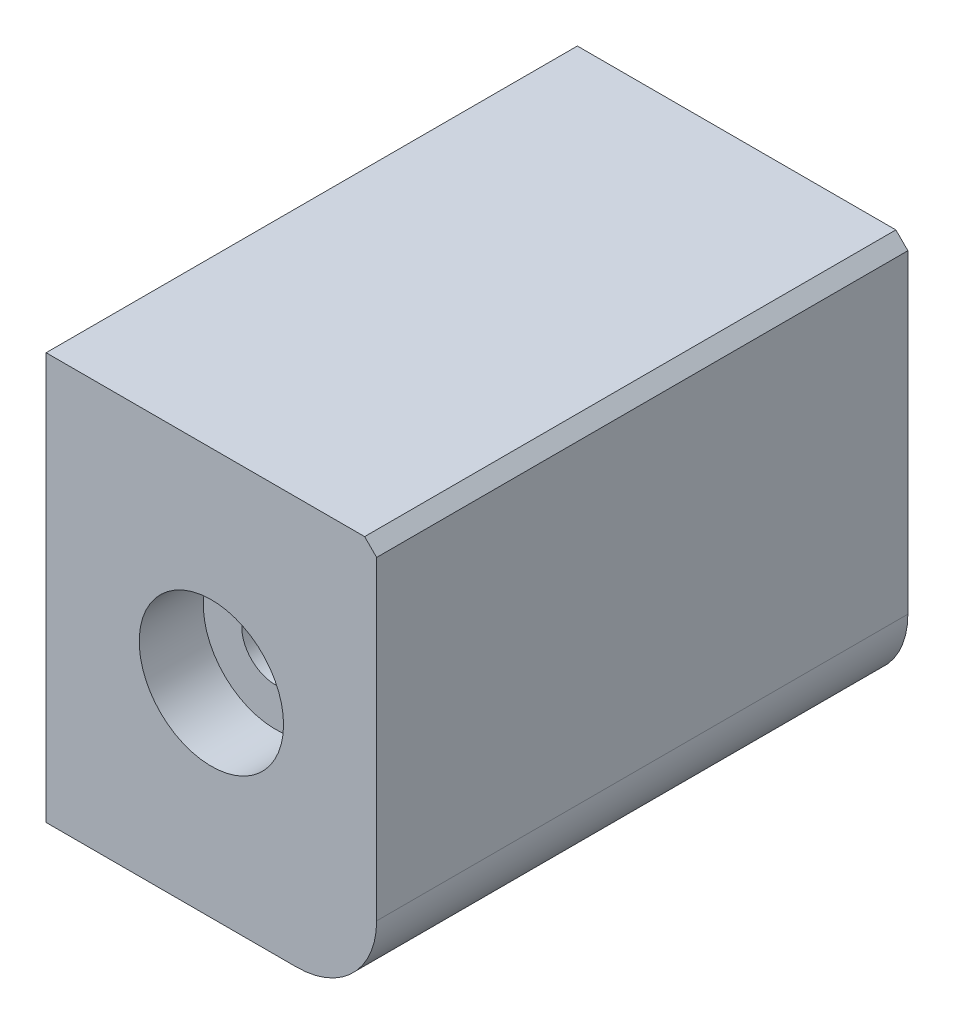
ISO-10303-21;
HEADER;
FILE_DESCRIPTION(('STEP AP214'),'2;1');
FILE_NAME('part.step','',(''),(''),'','','');
FILE_SCHEMA(('AUTOMOTIVE_DESIGN { 1 0 10303 214 1 1 1 1 }'));
ENDSEC;
DATA;
#1=APPLICATION_CONTEXT('core data for automotive mechanical design processes');
#2=APPLICATION_PROTOCOL_DEFINITION('international standard','automotive_design',2000,#1);
#3=PRODUCT_CONTEXT('',#1,'mechanical');
#4=PRODUCT('Part','Part','',(#3));
#5=PRODUCT_RELATED_PRODUCT_CATEGORY('part','',(#4));
#6=PRODUCT_DEFINITION_FORMATION('','',#4);
#7=PRODUCT_DEFINITION_CONTEXT('part definition',#1,'design');
#8=PRODUCT_DEFINITION('design','',#6,#7);
#9=PRODUCT_DEFINITION_SHAPE('','',#8);
#10=(LENGTH_UNIT() NAMED_UNIT(*) SI_UNIT(.MILLI.,.METRE.));
#11=(NAMED_UNIT(*) PLANE_ANGLE_UNIT() SI_UNIT($,.RADIAN.));
#12=(NAMED_UNIT(*) SI_UNIT($,.STERADIAN.) SOLID_ANGLE_UNIT());
#13=UNCERTAINTY_MEASURE_WITH_UNIT(LENGTH_MEASURE(1.E-05),#10,'distance_accuracy_value','');
#14=(GEOMETRIC_REPRESENTATION_CONTEXT(3) GLOBAL_UNCERTAINTY_ASSIGNED_CONTEXT((#13)) GLOBAL_UNIT_ASSIGNED_CONTEXT((#10,
#11,#12)) REPRESENTATION_CONTEXT('',''));
#15=CARTESIAN_POINT('',(0.,0.,0.));
#16=DIRECTION('',(0.,0.,1.));
#17=DIRECTION('',(1.,0.,0.));
#18=AXIS2_PLACEMENT_3D('',#15,#16,#17);
#19=CARTESIAN_POINT('',(31.27,-40.8,66.33));
#20=DIRECTION('',(0.,0.,-1.));
#21=DIRECTION('',(-1.,0.,0.));
#22=AXIS2_PLACEMENT_3D('',#19,#20,#21);
#23=CYLINDRICAL_SURFACE('',#22,10.);
#24=CARTESIAN_POINT('',(31.27,-40.8,0.));
#25=DIRECTION('',(0.,0.,1.));
#26=DIRECTION('',(-1.,0.,0.));
#27=AXIS2_PLACEMENT_3D('',#24,#25,#26);
#28=CIRCLE('',#27,10.);
#29=CARTESIAN_POINT('',(31.27,-50.8,0.));
#30=VERTEX_POINT('',#29);
#31=CARTESIAN_POINT('',(41.27,-40.8,0.));
#32=VERTEX_POINT('',#31);
#33=EDGE_CURVE('E121',#30,#32,#28,.T.);
#34=ORIENTED_EDGE('',*,*,#33,.T.);
#35=DIRECTION('',(0.,0.,-1.));
#36=VECTOR('',#35,1.);
#37=CARTESIAN_POINT('',(41.27,-40.8,66.33));
#38=LINE('',#37,#36);
#39=CARTESIAN_POINT('',(41.27,-40.8,66.33));
#40=VERTEX_POINT('',#39);
#41=EDGE_CURVE('E154',#40,#32,#38,.T.);
#42=ORIENTED_EDGE('',*,*,#41,.F.);
#43=CARTESIAN_POINT('',(31.27,-40.8,66.33));
#44=DIRECTION('',(0.,0.,1.));
#45=DIRECTION('',(-1.,0.,0.));
#46=AXIS2_PLACEMENT_3D('',#43,#44,#45);
#47=CIRCLE('',#46,10.);
#48=CARTESIAN_POINT('',(31.27,-50.8,66.33));
#49=VERTEX_POINT('',#48);
#50=EDGE_CURVE('E124',#49,#40,#47,.T.);
#51=ORIENTED_EDGE('',*,*,#50,.F.);
#52=DIRECTION('',(0.,0.,-1.));
#53=VECTOR('',#52,1.);
#54=CARTESIAN_POINT('',(31.27,-50.8,66.33));
#55=LINE('',#54,#53);
#56=EDGE_CURVE('E136',#49,#30,#55,.T.);
#57=ORIENTED_EDGE('',*,*,#56,.T.);
#58=EDGE_LOOP('',(#34,#42,#51,#57));
#59=FACE_BOUND('',#58,.T.);
#60=ADVANCED_FACE('F32',(#59),#23,.T.);
#61=CARTESIAN_POINT('',(41.27,-40.8,66.33));
#62=DIRECTION('',(-1.,0.,0.));
#63=DIRECTION('',(0.,-1.,0.));
#64=AXIS2_PLACEMENT_3D('',#61,#62,#63);
#65=PLANE('',#64);
#66=DIRECTION('',(0.,1.,0.));
#67=VECTOR('',#66,1.);
#68=CARTESIAN_POINT('',(41.27,-40.8,0.));
#69=LINE('',#68,#67);
#70=CARTESIAN_POINT('',(41.27,-1.49999999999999,0.));
#71=VERTEX_POINT('',#70);
#72=EDGE_CURVE('E139',#32,#71,#69,.T.);
#73=ORIENTED_EDGE('',*,*,#72,.T.);
#74=DIRECTION('',(0.,0.,1.));
#75=VECTOR('',#74,1.);
#76=CARTESIAN_POINT('',(41.27,-1.49999999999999,66.33));
#77=LINE('',#76,#75);
#78=CARTESIAN_POINT('',(41.27,-1.5,66.33));
#79=VERTEX_POINT('',#78);
#80=EDGE_CURVE('E40',#71,#79,#77,.T.);
#81=ORIENTED_EDGE('',*,*,#80,.T.);
#82=DIRECTION('',(0.,1.,0.));
#83=VECTOR('',#82,1.);
#84=CARTESIAN_POINT('',(41.27,-40.8,66.33));
#85=LINE('',#84,#83);
#86=EDGE_CURVE('E127',#40,#79,#85,.T.);
#87=ORIENTED_EDGE('',*,*,#86,.F.);
#88=ORIENTED_EDGE('',*,*,#41,.T.);
#89=EDGE_LOOP('',(#73,#81,#87,#88));
#90=FACE_BOUND('',#89,.T.);
#91=ADVANCED_FACE('F189',(#90),#65,.F.);
#92=CARTESIAN_POINT('',(0.,0.,66.33));
#93=DIRECTION('',(0.,-1.,0.));
#94=DIRECTION('',(1.,0.,0.));
#95=AXIS2_PLACEMENT_3D('',#92,#93,#94);
#96=PLANE('',#95);
#97=DIRECTION('',(-1.,0.,0.));
#98=VECTOR('',#97,1.);
#99=CARTESIAN_POINT('',(0.,0.,66.33));
#100=LINE('',#99,#98);
#101=CARTESIAN_POINT('',(39.77,0.,66.33));
#102=VERTEX_POINT('',#101);
#103=CARTESIAN_POINT('',(0.,0.,66.33));
#104=VERTEX_POINT('',#103);
#105=EDGE_CURVE('E130',#102,#104,#100,.T.);
#106=ORIENTED_EDGE('',*,*,#105,.F.);
#107=DIRECTION('',(0.,0.,-1.));
#108=VECTOR('',#107,1.);
#109=CARTESIAN_POINT('',(39.77,0.,66.33));
#110=LINE('',#109,#108);
#111=CARTESIAN_POINT('',(39.77,0.,0.));
#112=VERTEX_POINT('',#111);
#113=EDGE_CURVE('E157',#102,#112,#110,.T.);
#114=ORIENTED_EDGE('',*,*,#113,.T.);
#115=DIRECTION('',(-1.,0.,0.));
#116=VECTOR('',#115,1.);
#117=CARTESIAN_POINT('',(0.,0.,0.));
#118=LINE('',#117,#116);
#119=CARTESIAN_POINT('',(0.,0.,0.));
#120=VERTEX_POINT('',#119);
#121=EDGE_CURVE('E141',#112,#120,#118,.T.);
#122=ORIENTED_EDGE('',*,*,#121,.T.);
#123=DIRECTION('',(0.,0.,-1.));
#124=VECTOR('',#123,1.);
#125=CARTESIAN_POINT('',(0.,0.,66.33));
#126=LINE('',#125,#124);
#127=EDGE_CURVE('E151',#104,#120,#126,.T.);
#128=ORIENTED_EDGE('',*,*,#127,.F.);
#129=EDGE_LOOP('',(#106,#114,#122,#128));
#130=FACE_BOUND('',#129,.T.);
#131=ADVANCED_FACE('F165',(#130),#96,.F.);
#132=CARTESIAN_POINT('',(0.,-50.8,66.33));
#133=DIRECTION('',(1.,0.,0.));
#134=DIRECTION('',(0.,0.,-1.));
#135=AXIS2_PLACEMENT_3D('',#132,#133,#134);
#136=PLANE('',#135);
#137=DIRECTION('',(0.,-1.,0.));
#138=VECTOR('',#137,1.);
#139=CARTESIAN_POINT('',(0.,-50.8,0.));
#140=LINE('',#139,#138);
#141=CARTESIAN_POINT('',(0.,-50.8,0.));
#142=VERTEX_POINT('',#141);
#143=EDGE_CURVE('E143',#120,#142,#140,.T.);
#144=ORIENTED_EDGE('',*,*,#143,.T.);
#145=DIRECTION('',(0.,0.,-1.));
#146=VECTOR('',#145,1.);
#147=CARTESIAN_POINT('',(0.,-50.8,66.33));
#148=LINE('',#147,#146);
#149=CARTESIAN_POINT('',(0.,-50.8,66.33));
#150=VERTEX_POINT('',#149);
#151=EDGE_CURVE('E148',#150,#142,#148,.T.);
#152=ORIENTED_EDGE('',*,*,#151,.F.);
#153=DIRECTION('',(0.,-1.,0.));
#154=VECTOR('',#153,1.);
#155=CARTESIAN_POINT('',(0.,-50.8,66.33));
#156=LINE('',#155,#154);
#157=EDGE_CURVE('E132',#104,#150,#156,.T.);
#158=ORIENTED_EDGE('',*,*,#157,.F.);
#159=ORIENTED_EDGE('',*,*,#127,.T.);
#160=EDGE_LOOP('',(#144,#152,#158,#159));
#161=FACE_BOUND('',#160,.T.);
#162=ADVANCED_FACE('F175',(#161),#136,.F.);
#163=CARTESIAN_POINT('',(0.,-50.8,66.33));
#164=DIRECTION('',(0.,1.,0.));
#165=DIRECTION('',(0.,0.,1.));
#166=AXIS2_PLACEMENT_3D('',#163,#164,#165);
#167=PLANE('',#166);
#168=DIRECTION('',(1.,0.,0.));
#169=VECTOR('',#168,1.);
#170=CARTESIAN_POINT('',(0.,-50.8,0.));
#171=LINE('',#170,#169);
#172=EDGE_CURVE('E128',#142,#30,#171,.T.);
#173=ORIENTED_EDGE('',*,*,#172,.T.);
#174=ORIENTED_EDGE('',*,*,#56,.F.);
#175=DIRECTION('',(1.,0.,0.));
#176=VECTOR('',#175,1.);
#177=CARTESIAN_POINT('',(0.,-50.8,66.33));
#178=LINE('',#177,#176);
#179=EDGE_CURVE('E134',#150,#49,#178,.T.);
#180=ORIENTED_EDGE('',*,*,#179,.F.);
#181=ORIENTED_EDGE('',*,*,#151,.T.);
#182=EDGE_LOOP('',(#173,#174,#180,#181));
#183=FACE_BOUND('',#182,.T.);
#184=ADVANCED_FACE('F179',(#183),#167,.F.);
#185=CARTESIAN_POINT('',(31.27,-40.8,66.33));
#186=DIRECTION('',(0.,0.,-1.));
#187=DIRECTION('',(-1.,0.,0.));
#188=AXIS2_PLACEMENT_3D('',#185,#186,#187);
#189=PLANE('',#188);
#190=CARTESIAN_POINT('',(20.635,-25.4,66.33));
#191=DIRECTION('',(0.,0.,1.));
#192=DIRECTION('',(1.,0.,0.));
#193=AXIS2_PLACEMENT_3D('',#190,#191,#192);
#194=CIRCLE('',#193,9.01);
#195=CARTESIAN_POINT('',(29.645,-25.4,66.33));
#196=VERTEX_POINT('',#195);
#197=EDGE_CURVE('E117',#196,#196,#194,.T.);
#198=ORIENTED_EDGE('',*,*,#197,.F.);
#199=EDGE_LOOP('',(#198));
#200=FACE_BOUND('',#199,.T.);
#201=ORIENTED_EDGE('',*,*,#86,.T.);
#202=DIRECTION('',(0.707106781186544,-0.707106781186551,0.));
#203=VECTOR('',#202,1.);
#204=CARTESIAN_POINT('',(39.77,0.,66.33));
#205=LINE('',#204,#203);
#206=EDGE_CURVE('E11',#79,#102,#205,.F.);
#207=ORIENTED_EDGE('',*,*,#206,.T.);
#208=ORIENTED_EDGE('',*,*,#105,.T.);
#209=ORIENTED_EDGE('',*,*,#157,.T.);
#210=ORIENTED_EDGE('',*,*,#179,.T.);
#211=ORIENTED_EDGE('',*,*,#50,.T.);
#212=EDGE_LOOP('',(#201,#207,#208,#209,#210,#211));
#213=FACE_BOUND('',#212,.T.);
#214=ADVANCED_FACE('F183',(#200,#213),#189,.F.);
#215=CARTESIAN_POINT('',(31.27,-40.8,0.));
#216=DIRECTION('',(0.,0.,-1.));
#217=DIRECTION('',(-1.,0.,0.));
#218=AXIS2_PLACEMENT_3D('',#215,#216,#217);
#219=PLANE('',#218);
#220=CARTESIAN_POINT('',(20.635,-39.4,0.));
#221=DIRECTION('',(0.,0.,-1.));
#222=DIRECTION('',(-1.,0.,0.));
#223=AXIS2_PLACEMENT_3D('',#220,#221,#222);
#224=CIRCLE('',#223,3.);
#225=CARTESIAN_POINT('',(17.635,-39.4,0.));
#226=VERTEX_POINT('',#225);
#227=EDGE_CURVE('E96',#226,#226,#224,.T.);
#228=ORIENTED_EDGE('',*,*,#227,.F.);
#229=EDGE_LOOP('',(#228));
#230=FACE_BOUND('',#229,.T.);
#231=CARTESIAN_POINT('',(20.635,-25.4,0.));
#232=DIRECTION('',(0.,0.,-1.));
#233=DIRECTION('',(-1.,0.,0.));
#234=AXIS2_PLACEMENT_3D('',#231,#232,#233);
#235=CIRCLE('',#234,9.01000000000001);
#236=CARTESIAN_POINT('',(11.625,-25.4,0.));
#237=VERTEX_POINT('',#236);
#238=EDGE_CURVE('E103',#237,#237,#235,.T.);
#239=ORIENTED_EDGE('',*,*,#238,.F.);
#240=EDGE_LOOP('',(#239));
#241=FACE_BOUND('',#240,.T.);
#242=ORIENTED_EDGE('',*,*,#121,.F.);
#243=DIRECTION('',(-0.707106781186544,0.707106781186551,0.));
#244=VECTOR('',#243,1.);
#245=CARTESIAN_POINT('',(55.9200000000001,-16.1500000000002,0.));
#246=LINE('',#245,#244);
#247=EDGE_CURVE('E54',#112,#71,#246,.F.);
#248=ORIENTED_EDGE('',*,*,#247,.T.);
#249=ORIENTED_EDGE('',*,*,#72,.F.);
#250=ORIENTED_EDGE('',*,*,#33,.F.);
#251=ORIENTED_EDGE('',*,*,#172,.F.);
#252=ORIENTED_EDGE('',*,*,#143,.F.);
#253=EDGE_LOOP('',(#242,#248,#249,#250,#251,#252));
#254=FACE_BOUND('',#253,.T.);
#255=ADVANCED_FACE('F170',(#230,#241,#254),#219,.T.);
#256=CARTESIAN_POINT('',(20.635,-25.4,58.33));
#257=DIRECTION('',(0.,0.,1.));
#258=DIRECTION('',(1.,0.,0.));
#259=AXIS2_PLACEMENT_3D('',#256,#257,#258);
#260=CYLINDRICAL_SURFACE('',#259,9.01);
#261=CARTESIAN_POINT('',(20.635,-25.4,58.33));
#262=DIRECTION('',(0.,0.,1.));
#263=DIRECTION('',(1.,0.,0.));
#264=AXIS2_PLACEMENT_3D('',#261,#262,#263);
#265=CIRCLE('',#264,9.01);
#266=CARTESIAN_POINT('',(29.645,-25.4,58.33));
#267=VERTEX_POINT('',#266);
#268=EDGE_CURVE('E118',#267,#267,#265,.T.);
#269=ORIENTED_EDGE('',*,*,#268,.F.);
#270=EDGE_LOOP('',(#269));
#271=FACE_BOUND('',#270,.T.);
#272=ORIENTED_EDGE('',*,*,#197,.T.);
#273=EDGE_LOOP('',(#272));
#274=FACE_BOUND('',#273,.T.);
#275=ADVANCED_FACE('F204',(#271,#274),#260,.F.);
#276=CARTESIAN_POINT('',(20.635,-25.4,58.33));
#277=DIRECTION('',(0.,0.,1.));
#278=DIRECTION('',(1.,0.,0.));
#279=AXIS2_PLACEMENT_3D('',#276,#277,#278);
#280=PLANE('',#279);
#281=CARTESIAN_POINT('',(20.625,-25.4,58.33));
#282=DIRECTION('',(0.,0.,1.));
#283=DIRECTION('',(1.,0.,0.));
#284=AXIS2_PLACEMENT_3D('',#281,#282,#283);
#285=CIRCLE('',#284,4.2);
#286=CARTESIAN_POINT('',(24.825,-25.4,58.33));
#287=VERTEX_POINT('',#286);
#288=EDGE_CURVE('E114',#287,#287,#285,.T.);
#289=ORIENTED_EDGE('',*,*,#288,.F.);
#290=EDGE_LOOP('',(#289));
#291=FACE_BOUND('',#290,.T.);
#292=ORIENTED_EDGE('',*,*,#268,.T.);
#293=EDGE_LOOP('',(#292));
#294=FACE_BOUND('',#293,.T.);
#295=ADVANCED_FACE('F211',(#291,#294),#280,.T.);
#296=CARTESIAN_POINT('',(20.625,-25.4,42.83));
#297=DIRECTION('',(0.,0.,1.));
#298=DIRECTION('',(1.,0.,0.));
#299=AXIS2_PLACEMENT_3D('',#296,#297,#298);
#300=CYLINDRICAL_SURFACE('',#299,4.2);
#301=CARTESIAN_POINT('',(20.625,-25.4,42.83));
#302=DIRECTION('',(0.,0.,1.));
#303=DIRECTION('',(1.,0.,0.));
#304=AXIS2_PLACEMENT_3D('',#301,#302,#303);
#305=CIRCLE('',#304,4.2);
#306=CARTESIAN_POINT('',(24.825,-25.4,42.83));
#307=VERTEX_POINT('',#306);
#308=EDGE_CURVE('E111',#307,#307,#305,.T.);
#309=ORIENTED_EDGE('',*,*,#308,.F.);
#310=EDGE_LOOP('',(#309));
#311=FACE_BOUND('',#310,.T.);
#312=ORIENTED_EDGE('',*,*,#288,.T.);
#313=EDGE_LOOP('',(#312));
#314=FACE_BOUND('',#313,.T.);
#315=ADVANCED_FACE('F215',(#311,#314),#300,.F.);
#316=CARTESIAN_POINT('',(20.625,-25.4,42.83));
#317=DIRECTION('',(0.,0.,1.));
#318=DIRECTION('',(1.,0.,0.));
#319=AXIS2_PLACEMENT_3D('',#316,#317,#318);
#320=CONICAL_SURFACE('',#319,4.2,1.0471975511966);
#321=CARTESIAN_POINT('',(20.625,-25.4,40.4051288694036));
#322=VERTEX_POINT('',#321);
#323=VERTEX_LOOP('',#322);
#324=FACE_BOUND('',#323,.T.);
#325=ORIENTED_EDGE('',*,*,#308,.T.);
#326=EDGE_LOOP('',(#325));
#327=FACE_BOUND('',#326,.T.);
#328=ADVANCED_FACE('F219',(#324,#327),#320,.F.);
#329=CARTESIAN_POINT('',(20.635,-25.4,8.));
#330=DIRECTION('',(0.,0.,-1.));
#331=DIRECTION('',(-1.,0.,0.));
#332=AXIS2_PLACEMENT_3D('',#329,#330,#331);
#333=PLANE('',#332);
#334=CARTESIAN_POINT('',(20.635,-25.4,8.));
#335=DIRECTION('',(0.,0.,-1.));
#336=DIRECTION('',(-1.,0.,0.));
#337=AXIS2_PLACEMENT_3D('',#334,#335,#336);
#338=CIRCLE('',#337,9.01000000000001);
#339=CARTESIAN_POINT('',(11.625,-25.4,8.));
#340=VERTEX_POINT('',#339);
#341=EDGE_CURVE('E105',#340,#340,#338,.T.);
#342=ORIENTED_EDGE('',*,*,#341,.T.);
#343=EDGE_LOOP('',(#342));
#344=FACE_BOUND('',#343,.T.);
#345=CARTESIAN_POINT('',(20.635,-25.4,8.));
#346=DIRECTION('',(0.,0.,-1.));
#347=DIRECTION('',(-1.,0.,0.));
#348=AXIS2_PLACEMENT_3D('',#345,#346,#347);
#349=CIRCLE('',#348,4.2);
#350=CARTESIAN_POINT('',(16.435,-25.4,8.));
#351=VERTEX_POINT('',#350);
#352=EDGE_CURVE('E108',#351,#351,#349,.F.);
#353=ORIENTED_EDGE('',*,*,#352,.T.);
#354=EDGE_LOOP('',(#353));
#355=FACE_BOUND('',#354,.T.);
#356=ADVANCED_FACE('F223',(#344,#355),#333,.T.);
#357=CARTESIAN_POINT('',(20.635,-25.4,8.));
#358=DIRECTION('',(0.,0.,-1.));
#359=DIRECTION('',(-1.,0.,0.));
#360=AXIS2_PLACEMENT_3D('',#357,#358,#359);
#361=CYLINDRICAL_SURFACE('',#360,9.01000000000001);
#362=ORIENTED_EDGE('',*,*,#341,.F.);
#363=EDGE_LOOP('',(#362));
#364=FACE_BOUND('',#363,.T.);
#365=ORIENTED_EDGE('',*,*,#238,.T.);
#366=EDGE_LOOP('',(#365));
#367=FACE_BOUND('',#366,.T.);
#368=ADVANCED_FACE('F229',(#364,#367),#361,.F.);
#369=CARTESIAN_POINT('',(20.635,-25.4,22.));
#370=DIRECTION('',(0.,0.,-1.));
#371=DIRECTION('',(-1.,0.,0.));
#372=AXIS2_PLACEMENT_3D('',#369,#370,#371);
#373=CYLINDRICAL_SURFACE('',#372,4.2);
#374=CARTESIAN_POINT('',(20.635,-25.4,22.));
#375=DIRECTION('',(0.,0.,-1.));
#376=DIRECTION('',(-1.,0.,0.));
#377=AXIS2_PLACEMENT_3D('',#374,#375,#376);
#378=CIRCLE('',#377,4.2);
#379=CARTESIAN_POINT('',(16.435,-25.4,22.));
#380=VERTEX_POINT('',#379);
#381=EDGE_CURVE('E94',#380,#380,#378,.T.);
#382=ORIENTED_EDGE('',*,*,#381,.F.);
#383=EDGE_LOOP('',(#382));
#384=FACE_BOUND('',#383,.T.);
#385=ORIENTED_EDGE('',*,*,#352,.F.);
#386=EDGE_LOOP('',(#385));
#387=FACE_BOUND('',#386,.T.);
#388=ADVANCED_FACE('F225',(#384,#387),#373,.F.);
#389=CARTESIAN_POINT('',(20.635,-39.4,8.));
#390=DIRECTION('',(0.,0.,-1.));
#391=DIRECTION('',(-1.,0.,0.));
#392=AXIS2_PLACEMENT_3D('',#389,#390,#391);
#393=CYLINDRICAL_SURFACE('',#392,3.);
#394=CARTESIAN_POINT('',(20.635,-39.4,8.));
#395=DIRECTION('',(0.,0.,-1.));
#396=DIRECTION('',(-1.,0.,0.));
#397=AXIS2_PLACEMENT_3D('',#394,#395,#396);
#398=CIRCLE('',#397,3.);
#399=CARTESIAN_POINT('',(17.635,-39.4,8.));
#400=VERTEX_POINT('',#399);
#401=EDGE_CURVE('E99',#400,#400,#398,.T.);
#402=ORIENTED_EDGE('',*,*,#401,.F.);
#403=EDGE_LOOP('',(#402));
#404=FACE_BOUND('',#403,.T.);
#405=ORIENTED_EDGE('',*,*,#227,.T.);
#406=EDGE_LOOP('',(#405));
#407=FACE_BOUND('',#406,.T.);
#408=ADVANCED_FACE('F228',(#404,#407),#393,.F.);
#409=CARTESIAN_POINT('',(20.635,-39.4,8.));
#410=DIRECTION('',(0.,0.,-1.));
#411=DIRECTION('',(-1.,0.,0.));
#412=AXIS2_PLACEMENT_3D('',#409,#410,#411);
#413=PLANE('',#412);
#414=ORIENTED_EDGE('',*,*,#401,.T.);
#415=EDGE_LOOP('',(#414));
#416=FACE_BOUND('',#415,.T.);
#417=ADVANCED_FACE('F90',(#416),#413,.T.);
#418=CARTESIAN_POINT('',(20.635,-25.4,22.));
#419=DIRECTION('',(0.,0.,-1.));
#420=DIRECTION('',(-1.,0.,0.));
#421=AXIS2_PLACEMENT_3D('',#418,#419,#420);
#422=CONICAL_SURFACE('',#421,4.2,1.0471975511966);
#423=CARTESIAN_POINT('',(20.635,-25.4,24.4248711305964));
#424=VERTEX_POINT('',#423);
#425=VERTEX_LOOP('',#424);
#426=FACE_BOUND('',#425,.T.);
#427=ORIENTED_EDGE('',*,*,#381,.T.);
#428=EDGE_LOOP('',(#427));
#429=FACE_BOUND('',#428,.T.);
#430=ADVANCED_FACE('F87',(#426,#429),#422,.F.);
#431=CARTESIAN_POINT('',(39.77,0.,66.33));
#432=DIRECTION('',(-0.707106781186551,-0.707106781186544,0.));
#433=DIRECTION('',(0.707106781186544,-0.707106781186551,0.));
#434=AXIS2_PLACEMENT_3D('',#431,#432,#433);
#435=PLANE('',#434);
#436=ORIENTED_EDGE('',*,*,#206,.F.);
#437=ORIENTED_EDGE('',*,*,#80,.F.);
#438=ORIENTED_EDGE('',*,*,#247,.F.);
#439=ORIENTED_EDGE('',*,*,#113,.F.);
#440=EDGE_LOOP('',(#436,#437,#438,#439));
#441=FACE_BOUND('',#440,.T.);
#442=ADVANCED_FACE('F34',(#441),#435,.F.);
#443=CLOSED_SHELL('',(#60,#91,#131,#162,#184,#214,#255,#275,#295,#315,#328,#356,#368,#388,#408,
#417,#430,#442));
#444=MANIFOLD_SOLID_BREP('B2',#443);
#445=ADVANCED_BREP_SHAPE_REPRESENTATION('',(#18,#444),#14);
#446=SHAPE_DEFINITION_REPRESENTATION(#9,#445);
ENDSEC;
END-ISO-10303-21;
